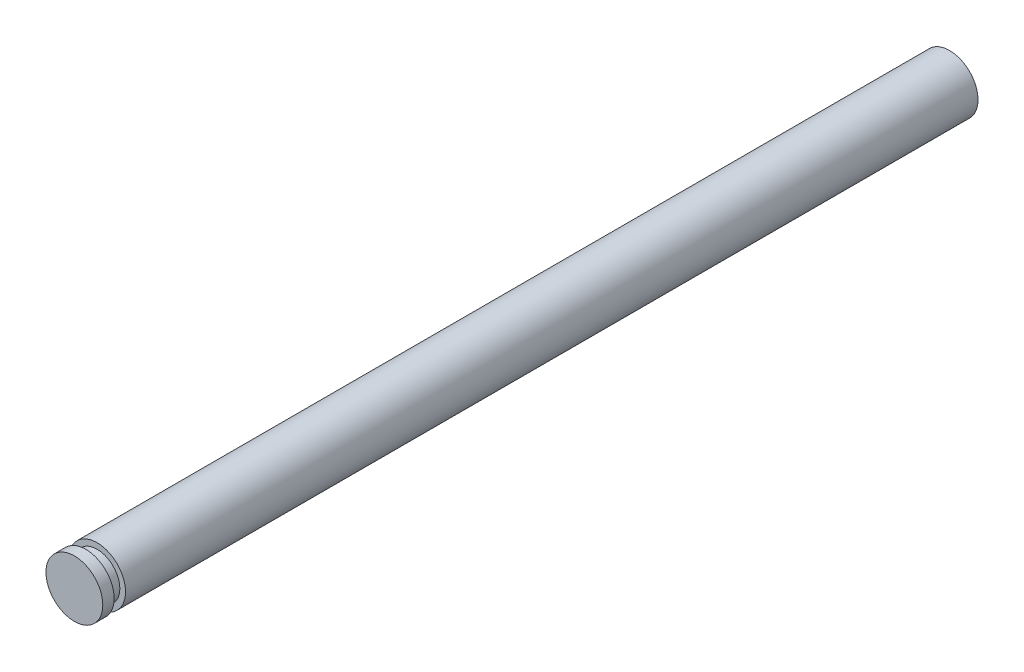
ISO-10303-21;
HEADER;
FILE_DESCRIPTION(('STEP AP214'),'2;1');
FILE_NAME('part.step','',(''),(''),'','','');
FILE_SCHEMA(('AUTOMOTIVE_DESIGN { 1 0 10303 214 1 1 1 1 }'));
ENDSEC;
DATA;
#1=APPLICATION_CONTEXT('core data for automotive mechanical design processes');
#2=APPLICATION_PROTOCOL_DEFINITION('international standard','automotive_design',2000,#1);
#3=PRODUCT_CONTEXT('',#1,'mechanical');
#4=PRODUCT('Part','Part','',(#3));
#5=PRODUCT_RELATED_PRODUCT_CATEGORY('part','',(#4));
#6=PRODUCT_DEFINITION_FORMATION('','',#4);
#7=PRODUCT_DEFINITION_CONTEXT('part definition',#1,'design');
#8=PRODUCT_DEFINITION('design','',#6,#7);
#9=PRODUCT_DEFINITION_SHAPE('','',#8);
#10=(LENGTH_UNIT() NAMED_UNIT(*) SI_UNIT(.MILLI.,.METRE.));
#11=(NAMED_UNIT(*) PLANE_ANGLE_UNIT() SI_UNIT($,.RADIAN.));
#12=(NAMED_UNIT(*) SI_UNIT($,.STERADIAN.) SOLID_ANGLE_UNIT());
#13=UNCERTAINTY_MEASURE_WITH_UNIT(LENGTH_MEASURE(1.E-05),#10,'distance_accuracy_value','');
#14=(GEOMETRIC_REPRESENTATION_CONTEXT(3) GLOBAL_UNCERTAINTY_ASSIGNED_CONTEXT((#13)) GLOBAL_UNIT_ASSIGNED_CONTEXT((#10,
#11,#12)) REPRESENTATION_CONTEXT('',''));
#15=CARTESIAN_POINT('',(0.,0.,0.));
#16=DIRECTION('',(0.,0.,1.));
#17=DIRECTION('',(1.,0.,0.));
#18=AXIS2_PLACEMENT_3D('',#15,#16,#17);
#19=CARTESIAN_POINT('',(0.,0.,-75.));
#20=DIRECTION('',(0.,0.,1.));
#21=DIRECTION('',(1.,0.,0.));
#22=AXIS2_PLACEMENT_3D('',#19,#20,#21);
#23=CYLINDRICAL_SURFACE('',#22,2.5);
#24=CARTESIAN_POINT('',(0.,0.,-75.));
#25=DIRECTION('',(0.,0.,1.));
#26=DIRECTION('',(1.,0.,0.));
#27=AXIS2_PLACEMENT_3D('',#24,#25,#26);
#28=CIRCLE('',#27,2.5);
#29=CARTESIAN_POINT('',(2.5,0.,-75.));
#30=VERTEX_POINT('',#29);
#31=EDGE_CURVE('E10',#30,#30,#28,.T.);
#32=ORIENTED_EDGE('',*,*,#31,.T.);
#33=EDGE_LOOP('',(#32));
#34=FACE_BOUND('',#33,.T.);
#35=CARTESIAN_POINT('',(0.,0.,0.));
#36=DIRECTION('',(0.,0.,1.));
#37=DIRECTION('',(1.,0.,0.));
#38=AXIS2_PLACEMENT_3D('',#35,#36,#37);
#39=CIRCLE('',#38,2.5);
#40=CARTESIAN_POINT('',(2.5,0.,0.));
#41=VERTEX_POINT('',#40);
#42=EDGE_CURVE('E35',#41,#41,#39,.F.);
#43=ORIENTED_EDGE('',*,*,#42,.T.);
#44=EDGE_LOOP('',(#43));
#45=FACE_BOUND('',#44,.T.);
#46=ADVANCED_FACE('F31',(#34,#45),#23,.T.);
#47=CARTESIAN_POINT('',(0.,0.,-75.));
#48=DIRECTION('',(0.,0.,1.));
#49=DIRECTION('',(1.,0.,0.));
#50=AXIS2_PLACEMENT_3D('',#47,#48,#49);
#51=PLANE('',#50);
#52=ORIENTED_EDGE('',*,*,#31,.F.);
#53=EDGE_LOOP('',(#52));
#54=FACE_BOUND('',#53,.T.);
#55=ADVANCED_FACE('F76',(#54),#51,.F.);
#56=CARTESIAN_POINT('',(0.,0.,0.));
#57=DIRECTION('',(0.,0.,1.));
#58=DIRECTION('',(1.,0.,0.));
#59=AXIS2_PLACEMENT_3D('',#56,#57,#58);
#60=PLANE('',#59);
#61=ORIENTED_EDGE('',*,*,#42,.F.);
#62=EDGE_LOOP('',(#61));
#63=FACE_BOUND('',#62,.T.);
#64=CARTESIAN_POINT('',(0.,0.,0.));
#65=DIRECTION('',(0.,0.,1.));
#66=DIRECTION('',(1.,0.,0.));
#67=AXIS2_PLACEMENT_3D('',#64,#65,#66);
#68=CIRCLE('',#67,2.);
#69=CARTESIAN_POINT('',(2.,0.,0.));
#70=VERTEX_POINT('',#69);
#71=EDGE_CURVE('E48',#70,#70,#68,.T.);
#72=ORIENTED_EDGE('',*,*,#71,.F.);
#73=EDGE_LOOP('',(#72));
#74=FACE_BOUND('',#73,.T.);
#75=ADVANCED_FACE('F72',(#63,#74),#60,.T.);
#76=CARTESIAN_POINT('',(0.,0.,1.));
#77=DIRECTION('',(0.,0.,1.));
#78=DIRECTION('',(1.,0.,0.));
#79=AXIS2_PLACEMENT_3D('',#76,#77,#78);
#80=PLANE('',#79);
#81=CARTESIAN_POINT('',(0.,0.,1.));
#82=DIRECTION('',(0.,0.,1.));
#83=DIRECTION('',(1.,0.,0.));
#84=AXIS2_PLACEMENT_3D('',#81,#82,#83);
#85=CIRCLE('',#84,2.5);
#86=CARTESIAN_POINT('',(2.5,0.,1.));
#87=VERTEX_POINT('',#86);
#88=EDGE_CURVE('E46',#87,#87,#85,.F.);
#89=ORIENTED_EDGE('',*,*,#88,.T.);
#90=EDGE_LOOP('',(#89));
#91=FACE_BOUND('',#90,.T.);
#92=CARTESIAN_POINT('',(0.,0.,1.));
#93=DIRECTION('',(0.,0.,1.));
#94=DIRECTION('',(1.,0.,0.));
#95=AXIS2_PLACEMENT_3D('',#92,#93,#94);
#96=CIRCLE('',#95,2.);
#97=CARTESIAN_POINT('',(2.,0.,1.));
#98=VERTEX_POINT('',#97);
#99=EDGE_CURVE('E53',#98,#98,#96,.T.);
#100=ORIENTED_EDGE('',*,*,#99,.T.);
#101=EDGE_LOOP('',(#100));
#102=FACE_BOUND('',#101,.T.);
#103=ADVANCED_FACE('F60',(#91,#102),#80,.F.);
#104=CARTESIAN_POINT('',(0.,0.,0.));
#105=DIRECTION('',(0.,0.,1.));
#106=DIRECTION('',(1.,0.,0.));
#107=AXIS2_PLACEMENT_3D('',#104,#105,#106);
#108=CYLINDRICAL_SURFACE('',#107,2.);
#109=ORIENTED_EDGE('',*,*,#71,.T.);
#110=EDGE_LOOP('',(#109));
#111=FACE_BOUND('',#110,.T.);
#112=ORIENTED_EDGE('',*,*,#99,.F.);
#113=EDGE_LOOP('',(#112));
#114=FACE_BOUND('',#113,.T.);
#115=ADVANCED_FACE('F62',(#111,#114),#108,.T.);
#116=CARTESIAN_POINT('',(0.,0.,2.));
#117=DIRECTION('',(0.,0.,1.));
#118=DIRECTION('',(1.,0.,0.));
#119=AXIS2_PLACEMENT_3D('',#116,#117,#118);
#120=PLANE('',#119);
#121=CARTESIAN_POINT('',(0.,0.,2.));
#122=DIRECTION('',(0.,0.,1.));
#123=DIRECTION('',(1.,0.,0.));
#124=AXIS2_PLACEMENT_3D('',#121,#122,#123);
#125=CIRCLE('',#124,2.5);
#126=CARTESIAN_POINT('',(2.5,0.,2.));
#127=VERTEX_POINT('',#126);
#128=EDGE_CURVE('E39',#127,#127,#125,.T.);
#129=ORIENTED_EDGE('',*,*,#128,.T.);
#130=EDGE_LOOP('',(#129));
#131=FACE_BOUND('',#130,.T.);
#132=ADVANCED_FACE('F64',(#131),#120,.T.);
#133=ORIENTED_EDGE('',*,*,#88,.F.);
#134=EDGE_LOOP('',(#133));
#135=FACE_BOUND('',#134,.T.);
#136=ORIENTED_EDGE('',*,*,#128,.F.);
#137=EDGE_LOOP('',(#136));
#138=FACE_BOUND('',#137,.T.);
#139=ADVANCED_FACE('F33',(#135,#138),#23,.T.);
#140=CLOSED_SHELL('',(#46,#55,#75,#103,#115,#132,#139));
#141=MANIFOLD_SOLID_BREP('B2',#140);
#142=ADVANCED_BREP_SHAPE_REPRESENTATION('',(#18,#141),#14);
#143=SHAPE_DEFINITION_REPRESENTATION(#9,#142);
ENDSEC;
END-ISO-10303-21;
